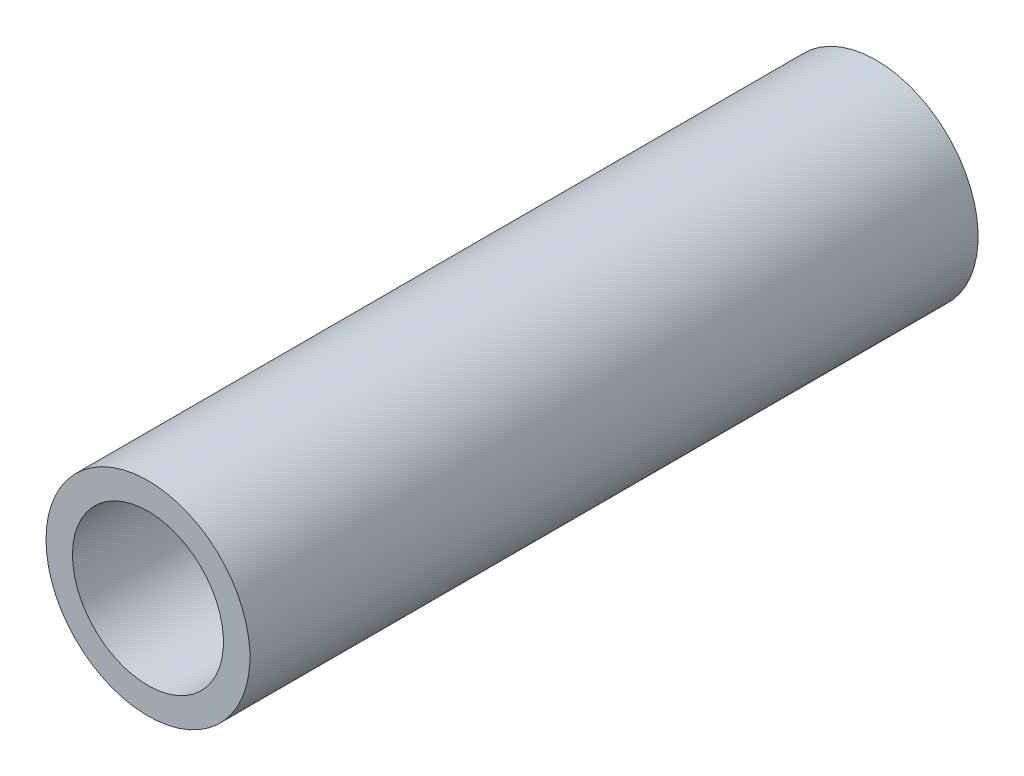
ISO-10303-21;
HEADER;
FILE_DESCRIPTION(('STEP AP214'),'2;1');
FILE_NAME('part.step','',(''),(''),'','','');
FILE_SCHEMA(('AUTOMOTIVE_DESIGN { 1 0 10303 214 1 1 1 1 }'));
ENDSEC;
DATA;
#1=APPLICATION_CONTEXT('core data for automotive mechanical design processes');
#2=APPLICATION_PROTOCOL_DEFINITION('international standard','automotive_design',2000,#1);
#3=PRODUCT_CONTEXT('',#1,'mechanical');
#4=PRODUCT('Part','Part','',(#3));
#5=PRODUCT_RELATED_PRODUCT_CATEGORY('part','',(#4));
#6=PRODUCT_DEFINITION_FORMATION('','',#4);
#7=PRODUCT_DEFINITION_CONTEXT('part definition',#1,'design');
#8=PRODUCT_DEFINITION('design','',#6,#7);
#9=PRODUCT_DEFINITION_SHAPE('','',#8);
#10=(LENGTH_UNIT() NAMED_UNIT(*) SI_UNIT(.MILLI.,.METRE.));
#11=(NAMED_UNIT(*) PLANE_ANGLE_UNIT() SI_UNIT($,.RADIAN.));
#12=(NAMED_UNIT(*) SI_UNIT($,.STERADIAN.) SOLID_ANGLE_UNIT());
#13=UNCERTAINTY_MEASURE_WITH_UNIT(LENGTH_MEASURE(1.E-05),#10,'distance_accuracy_value','');
#14=(GEOMETRIC_REPRESENTATION_CONTEXT(3) GLOBAL_UNCERTAINTY_ASSIGNED_CONTEXT((#13)) GLOBAL_UNIT_ASSIGNED_CONTEXT((#10,
#11,#12)) REPRESENTATION_CONTEXT('',''));
#15=CARTESIAN_POINT('',(0.,0.,0.));
#16=DIRECTION('',(0.,0.,1.));
#17=DIRECTION('',(1.,0.,0.));
#18=AXIS2_PLACEMENT_3D('',#15,#16,#17);
#19=CARTESIAN_POINT('',(0.,0.,76.2));
#20=DIRECTION('',(0.,0.,1.));
#21=DIRECTION('',(1.,0.,0.));
#22=AXIS2_PLACEMENT_3D('',#19,#20,#21);
#23=PLANE('',#22);
#24=CARTESIAN_POINT('',(0.,0.,76.2));
#25=DIRECTION('',(0.,0.,1.));
#26=DIRECTION('',(1.,0.,0.));
#27=AXIS2_PLACEMENT_3D('',#24,#25,#26);
#28=CIRCLE('',#27,10.668);
#29=CARTESIAN_POINT('',(-10.668,0.,76.2));
#30=VERTEX_POINT('',#29);
#31=EDGE_CURVE('E10',#30,#30,#28,.T.);
#32=ORIENTED_EDGE('',*,*,#31,.T.);
#33=EDGE_LOOP('',(#32));
#34=FACE_BOUND('',#33,.T.);
#35=CARTESIAN_POINT('',(0.,0.,76.2));
#36=DIRECTION('',(0.,0.,1.));
#37=DIRECTION('',(1.,0.,0.));
#38=AXIS2_PLACEMENT_3D('',#35,#36,#37);
#39=CIRCLE('',#38,7.8994);
#40=CARTESIAN_POINT('',(-7.8994,0.,76.2));
#41=VERTEX_POINT('',#40);
#42=EDGE_CURVE('E41',#41,#41,#39,.T.);
#43=ORIENTED_EDGE('',*,*,#42,.F.);
#44=EDGE_LOOP('',(#43));
#45=FACE_BOUND('',#44,.T.);
#46=ADVANCED_FACE('F30',(#34,#45),#23,.T.);
#47=CARTESIAN_POINT('',(0.,0.,0.));
#48=DIRECTION('',(0.,0.,1.));
#49=DIRECTION('',(1.,0.,0.));
#50=AXIS2_PLACEMENT_3D('',#47,#48,#49);
#51=PLANE('',#50);
#52=CARTESIAN_POINT('',(0.,0.,0.));
#53=DIRECTION('',(0.,0.,1.));
#54=DIRECTION('',(1.,0.,0.));
#55=AXIS2_PLACEMENT_3D('',#52,#53,#54);
#56=CIRCLE('',#55,10.668);
#57=CARTESIAN_POINT('',(-10.668,0.,0.));
#58=VERTEX_POINT('',#57);
#59=EDGE_CURVE('E34',#58,#58,#56,.T.);
#60=ORIENTED_EDGE('',*,*,#59,.F.);
#61=EDGE_LOOP('',(#60));
#62=FACE_BOUND('',#61,.T.);
#63=CARTESIAN_POINT('',(0.,0.,0.));
#64=DIRECTION('',(0.,0.,1.));
#65=DIRECTION('',(1.,0.,0.));
#66=AXIS2_PLACEMENT_3D('',#63,#64,#65);
#67=CIRCLE('',#66,7.8994);
#68=CARTESIAN_POINT('',(-7.8994,0.,0.));
#69=VERTEX_POINT('',#68);
#70=EDGE_CURVE('E43',#69,#69,#67,.T.);
#71=ORIENTED_EDGE('',*,*,#70,.T.);
#72=EDGE_LOOP('',(#71));
#73=FACE_BOUND('',#72,.T.);
#74=ADVANCED_FACE('F53',(#62,#73),#51,.F.);
#75=CARTESIAN_POINT('',(0.,0.,76.2));
#76=DIRECTION('',(0.,0.,-1.));
#77=DIRECTION('',(-1.,0.,0.));
#78=AXIS2_PLACEMENT_3D('',#75,#76,#77);
#79=CYLINDRICAL_SURFACE('',#78,10.668);
#80=CARTESIAN_POINT('',(-10.668,0.,76.2));
#81=CARTESIAN_POINT('',(-10.668,0.,75.40625));
#82=CARTESIAN_POINT('',(-10.668,0.,74.6125));
#83=CARTESIAN_POINT('',(-10.668,0.,73.025));
#84=CARTESIAN_POINT('',(-10.668,0.,72.23125));
#85=CARTESIAN_POINT('',(-10.668,0.,70.64375));
#86=CARTESIAN_POINT('',(-10.668,0.,69.85));
#87=CARTESIAN_POINT('',(-10.668,0.,68.2625));
#88=CARTESIAN_POINT('',(-10.668,0.,67.46875));
#89=CARTESIAN_POINT('',(-10.668,0.,65.88125));
#90=CARTESIAN_POINT('',(-10.668,0.,65.0875));
#91=CARTESIAN_POINT('',(-10.668,0.,63.5));
#92=CARTESIAN_POINT('',(-10.668,0.,62.70625));
#93=CARTESIAN_POINT('',(-10.668,0.,61.11875));
#94=CARTESIAN_POINT('',(-10.668,0.,60.325));
#95=CARTESIAN_POINT('',(-10.668,0.,58.7375));
#96=CARTESIAN_POINT('',(-10.668,0.,57.94375));
#97=CARTESIAN_POINT('',(-10.668,0.,56.35625));
#98=CARTESIAN_POINT('',(-10.668,0.,55.5625));
#99=CARTESIAN_POINT('',(-10.668,0.,53.975));
#100=CARTESIAN_POINT('',(-10.668,0.,53.18125));
#101=CARTESIAN_POINT('',(-10.668,0.,51.59375));
#102=CARTESIAN_POINT('',(-10.668,0.,50.8));
#103=CARTESIAN_POINT('',(-10.668,0.,49.2125));
#104=CARTESIAN_POINT('',(-10.668,0.,48.41875));
#105=CARTESIAN_POINT('',(-10.668,0.,46.83125));
#106=CARTESIAN_POINT('',(-10.668,0.,46.0375));
#107=CARTESIAN_POINT('',(-10.668,0.,44.45));
#108=CARTESIAN_POINT('',(-10.668,0.,43.65625));
#109=CARTESIAN_POINT('',(-10.668,0.,42.06875));
#110=CARTESIAN_POINT('',(-10.668,0.,41.275));
#111=CARTESIAN_POINT('',(-10.668,0.,39.6875));
#112=CARTESIAN_POINT('',(-10.668,0.,38.89375));
#113=CARTESIAN_POINT('',(-10.668,0.,37.30625));
#114=CARTESIAN_POINT('',(-10.668,0.,36.5125));
#115=CARTESIAN_POINT('',(-10.668,0.,34.925));
#116=CARTESIAN_POINT('',(-10.668,0.,34.13125));
#117=CARTESIAN_POINT('',(-10.668,0.,32.54375));
#118=CARTESIAN_POINT('',(-10.668,0.,31.75));
#119=CARTESIAN_POINT('',(-10.668,0.,30.1625));
#120=CARTESIAN_POINT('',(-10.668,0.,29.36875));
#121=CARTESIAN_POINT('',(-10.668,0.,27.78125));
#122=CARTESIAN_POINT('',(-10.668,0.,26.9875));
#123=CARTESIAN_POINT('',(-10.668,0.,25.4));
#124=CARTESIAN_POINT('',(-10.668,0.,24.60625));
#125=CARTESIAN_POINT('',(-10.668,0.,23.01875));
#126=CARTESIAN_POINT('',(-10.668,0.,22.225));
#127=CARTESIAN_POINT('',(-10.668,0.,20.6375));
#128=CARTESIAN_POINT('',(-10.668,0.,19.84375));
#129=CARTESIAN_POINT('',(-10.668,0.,18.25625));
#130=CARTESIAN_POINT('',(-10.668,0.,17.4625));
#131=CARTESIAN_POINT('',(-10.668,0.,15.875));
#132=CARTESIAN_POINT('',(-10.668,0.,15.08125));
#133=CARTESIAN_POINT('',(-10.668,0.,13.49375));
#134=CARTESIAN_POINT('',(-10.668,0.,12.7));
#135=CARTESIAN_POINT('',(-10.668,0.,11.1125));
#136=CARTESIAN_POINT('',(-10.668,0.,10.31875));
#137=CARTESIAN_POINT('',(-10.668,0.,8.73125));
#138=CARTESIAN_POINT('',(-10.668,0.,7.93750000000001));
#139=CARTESIAN_POINT('',(-10.668,0.,6.35));
#140=CARTESIAN_POINT('',(-10.668,0.,5.55625));
#141=CARTESIAN_POINT('',(-10.668,0.,3.96875));
#142=CARTESIAN_POINT('',(-10.668,0.,3.175));
#143=CARTESIAN_POINT('',(-10.668,0.,1.5875));
#144=CARTESIAN_POINT('',(-10.668,0.,0.793750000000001));
#145=CARTESIAN_POINT('',(-10.668,0.,0.));
#146=B_SPLINE_CURVE_WITH_KNOTS('',3,(#80,#81,#82,#83,#84,#85,#86,#87,#88,#89,#90,#91,#92,#93,
#94,#95,#96,#97,#98,#99,#100,#101,#102,#103,#104,#105,#106,#107,#108,#109,#110,#111,#112,#113,
#114,#115,#116,#117,#118,#119,#120,#121,#122,#123,#124,#125,#126,#127,#128,#129,#130,#131,#132,
#133,#134,#135,#136,#137,#138,#139,#140,#141,#142,#143,#144,#145),.UNSPECIFIED.,.F.,.F.,(4,2,2,
2,2,2,2,2,2,2,2,2,2,2,2,2,2,2,2,2,2,2,2,2,2,2,2,2,2,2,2,2,4),(0.,2.38125,4.7625,7.14375,
9.52500000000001,11.90625,14.2875,16.66875,19.05,21.43125,23.8125,26.19375,28.575,30.95625,
33.3375,35.71875,38.1,40.48125,42.8625,45.24375,47.625,50.00625,52.3875,54.76875,57.15,59.53125,
61.9125,64.29375,66.675,69.05625,71.4375,73.81875,76.2),.UNSPECIFIED.);
#147=EDGE_CURVE('BSEAM32',#30,#58,#146,.T.);
#148=ORIENTED_EDGE('',*,*,#31,.F.);
#149=ORIENTED_EDGE('',*,*,#59,.T.);
#150=ORIENTED_EDGE('',*,*,#147,.T.);
#151=ORIENTED_EDGE('',*,*,#147,.F.);
#152=EDGE_LOOP('',(#148,#150,#149,#151));
#153=FACE_BOUND('',#152,.T.);
#154=ADVANCED_FACE('F32',(#153),#79,.T.);
#155=CARTESIAN_POINT('',(0.,0.,76.2));
#156=DIRECTION('',(0.,0.,-1.));
#157=DIRECTION('',(-1.,0.,0.));
#158=AXIS2_PLACEMENT_3D('',#155,#156,#157);
#159=CYLINDRICAL_SURFACE('',#158,7.8994);
#160=CARTESIAN_POINT('',(-7.8994,0.,76.2));
#161=CARTESIAN_POINT('',(-7.8994,0.,75.40625));
#162=CARTESIAN_POINT('',(-7.8994,0.,74.6125));
#163=CARTESIAN_POINT('',(-7.8994,0.,73.025));
#164=CARTESIAN_POINT('',(-7.8994,0.,72.23125));
#165=CARTESIAN_POINT('',(-7.8994,0.,70.64375));
#166=CARTESIAN_POINT('',(-7.8994,0.,69.85));
#167=CARTESIAN_POINT('',(-7.8994,0.,68.2625));
#168=CARTESIAN_POINT('',(-7.8994,0.,67.46875));
#169=CARTESIAN_POINT('',(-7.8994,0.,65.88125));
#170=CARTESIAN_POINT('',(-7.8994,0.,65.0875));
#171=CARTESIAN_POINT('',(-7.8994,0.,63.5));
#172=CARTESIAN_POINT('',(-7.8994,0.,62.70625));
#173=CARTESIAN_POINT('',(-7.8994,0.,61.11875));
#174=CARTESIAN_POINT('',(-7.8994,0.,60.325));
#175=CARTESIAN_POINT('',(-7.8994,0.,58.7375));
#176=CARTESIAN_POINT('',(-7.8994,0.,57.94375));
#177=CARTESIAN_POINT('',(-7.8994,0.,56.35625));
#178=CARTESIAN_POINT('',(-7.8994,0.,55.5625));
#179=CARTESIAN_POINT('',(-7.8994,0.,53.975));
#180=CARTESIAN_POINT('',(-7.8994,0.,53.18125));
#181=CARTESIAN_POINT('',(-7.8994,0.,51.59375));
#182=CARTESIAN_POINT('',(-7.8994,0.,50.8));
#183=CARTESIAN_POINT('',(-7.8994,0.,49.2125));
#184=CARTESIAN_POINT('',(-7.8994,0.,48.41875));
#185=CARTESIAN_POINT('',(-7.8994,0.,46.83125));
#186=CARTESIAN_POINT('',(-7.8994,0.,46.0375));
#187=CARTESIAN_POINT('',(-7.8994,0.,44.45));
#188=CARTESIAN_POINT('',(-7.8994,0.,43.65625));
#189=CARTESIAN_POINT('',(-7.8994,0.,42.06875));
#190=CARTESIAN_POINT('',(-7.8994,0.,41.275));
#191=CARTESIAN_POINT('',(-7.8994,0.,39.6875));
#192=CARTESIAN_POINT('',(-7.8994,0.,38.89375));
#193=CARTESIAN_POINT('',(-7.8994,0.,37.30625));
#194=CARTESIAN_POINT('',(-7.8994,0.,36.5125));
#195=CARTESIAN_POINT('',(-7.8994,0.,34.925));
#196=CARTESIAN_POINT('',(-7.8994,0.,34.13125));
#197=CARTESIAN_POINT('',(-7.8994,0.,32.54375));
#198=CARTESIAN_POINT('',(-7.8994,0.,31.75));
#199=CARTESIAN_POINT('',(-7.8994,0.,30.1625));
#200=CARTESIAN_POINT('',(-7.8994,0.,29.36875));
#201=CARTESIAN_POINT('',(-7.8994,0.,27.78125));
#202=CARTESIAN_POINT('',(-7.8994,0.,26.9875));
#203=CARTESIAN_POINT('',(-7.8994,0.,25.4));
#204=CARTESIAN_POINT('',(-7.8994,0.,24.60625));
#205=CARTESIAN_POINT('',(-7.8994,0.,23.01875));
#206=CARTESIAN_POINT('',(-7.8994,0.,22.225));
#207=CARTESIAN_POINT('',(-7.8994,0.,20.6375));
#208=CARTESIAN_POINT('',(-7.8994,0.,19.84375));
#209=CARTESIAN_POINT('',(-7.8994,0.,18.25625));
#210=CARTESIAN_POINT('',(-7.8994,0.,17.4625));
#211=CARTESIAN_POINT('',(-7.8994,0.,15.875));
#212=CARTESIAN_POINT('',(-7.8994,0.,15.08125));
#213=CARTESIAN_POINT('',(-7.8994,0.,13.49375));
#214=CARTESIAN_POINT('',(-7.8994,0.,12.7));
#215=CARTESIAN_POINT('',(-7.8994,0.,11.1125));
#216=CARTESIAN_POINT('',(-7.8994,0.,10.31875));
#217=CARTESIAN_POINT('',(-7.8994,0.,8.73125));
#218=CARTESIAN_POINT('',(-7.8994,0.,7.93750000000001));
#219=CARTESIAN_POINT('',(-7.8994,0.,6.35));
#220=CARTESIAN_POINT('',(-7.8994,0.,5.55625));
#221=CARTESIAN_POINT('',(-7.8994,0.,3.96875));
#222=CARTESIAN_POINT('',(-7.8994,0.,3.175));
#223=CARTESIAN_POINT('',(-7.8994,0.,1.5875));
#224=CARTESIAN_POINT('',(-7.8994,0.,0.793750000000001));
#225=CARTESIAN_POINT('',(-7.8994,0.,0.));
#226=B_SPLINE_CURVE_WITH_KNOTS('',3,(#160,#161,#162,#163,#164,#165,#166,#167,#168,#169,#170,
#171,#172,#173,#174,#175,#176,#177,#178,#179,#180,#181,#182,#183,#184,#185,#186,#187,#188,#189,
#190,#191,#192,#193,#194,#195,#196,#197,#198,#199,#200,#201,#202,#203,#204,#205,#206,#207,#208,
#209,#210,#211,#212,#213,#214,#215,#216,#217,#218,#219,#220,#221,#222,#223,#224,#225),
.UNSPECIFIED.,.F.,.F.,(4,2,2,2,2,2,2,2,2,2,2,2,2,2,2,2,2,2,2,2,2,2,2,2,2,2,2,2,2,2,2,2,4),(0.,
2.38125,4.7625,7.14375,9.52500000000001,11.90625,14.2875,16.66875,19.05,21.43125,23.8125,
26.19375,28.575,30.95625,33.3375,35.71875,38.1,40.48125,42.8625,45.24375,47.625,50.00625,
52.3875,54.76875,57.15,59.53125,61.9125,64.29375,66.675,69.05625,71.4375,73.81875,76.2),.UNSPECIFIED.);
#227=EDGE_CURVE('BSEAM49',#41,#69,#226,.T.);
#228=ORIENTED_EDGE('',*,*,#42,.T.);
#229=ORIENTED_EDGE('',*,*,#70,.F.);
#230=ORIENTED_EDGE('',*,*,#227,.T.);
#231=ORIENTED_EDGE('',*,*,#227,.F.);
#232=EDGE_LOOP('',(#228,#230,#229,#231));
#233=FACE_BOUND('',#232,.T.);
#234=ADVANCED_FACE('F49',(#233),#159,.F.);
#235=CLOSED_SHELL('',(#46,#74,#154,#234));
#236=MANIFOLD_SOLID_BREP('B2',#235);
#237=ADVANCED_BREP_SHAPE_REPRESENTATION('',(#18,#236),#14);
#238=SHAPE_DEFINITION_REPRESENTATION(#9,#237);
ENDSEC;
END-ISO-10303-21;
